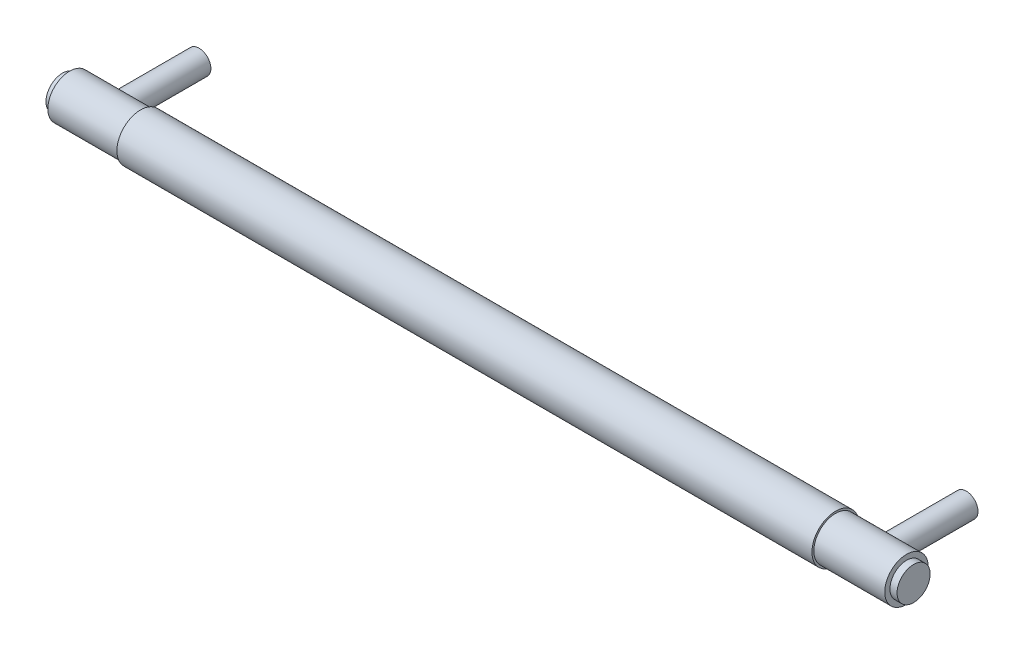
ISO-10303-21;
HEADER;
FILE_DESCRIPTION(('STEP AP214'),'2;1');
FILE_NAME('part.step','',(''),(''),'','','');
FILE_SCHEMA(('AUTOMOTIVE_DESIGN { 1 0 10303 214 1 1 1 1 }'));
ENDSEC;
DATA;
#1=APPLICATION_CONTEXT('core data for automotive mechanical design processes');
#2=APPLICATION_PROTOCOL_DEFINITION('international standard','automotive_design',2000,#1);
#3=PRODUCT_CONTEXT('',#1,'mechanical');
#4=PRODUCT('Part','Part','',(#3));
#5=PRODUCT_RELATED_PRODUCT_CATEGORY('part','',(#4));
#6=PRODUCT_DEFINITION_FORMATION('','',#4);
#7=PRODUCT_DEFINITION_CONTEXT('part definition',#1,'design');
#8=PRODUCT_DEFINITION('design','',#6,#7);
#9=PRODUCT_DEFINITION_SHAPE('','',#8);
#10=(LENGTH_UNIT() NAMED_UNIT(*) SI_UNIT(.MILLI.,.METRE.));
#11=(NAMED_UNIT(*) PLANE_ANGLE_UNIT() SI_UNIT($,.RADIAN.));
#12=(NAMED_UNIT(*) SI_UNIT($,.STERADIAN.) SOLID_ANGLE_UNIT());
#13=UNCERTAINTY_MEASURE_WITH_UNIT(LENGTH_MEASURE(1.E-05),#10,'distance_accuracy_value','');
#14=(GEOMETRIC_REPRESENTATION_CONTEXT(3) GLOBAL_UNCERTAINTY_ASSIGNED_CONTEXT((#13)) GLOBAL_UNIT_ASSIGNED_CONTEXT((#10,
#11,#12)) REPRESENTATION_CONTEXT('',''));
#15=CARTESIAN_POINT('',(0.,0.,0.));
#16=DIRECTION('',(0.,0.,1.));
#17=DIRECTION('',(1.,0.,0.));
#18=AXIS2_PLACEMENT_3D('',#15,#16,#17);
#19=CARTESIAN_POINT('',(177.,0.,0.));
#20=DIRECTION('',(-1.,0.,0.));
#21=DIRECTION('',(0.,0.,1.));
#22=AXIS2_PLACEMENT_3D('',#19,#20,#21);
#23=CYLINDRICAL_SURFACE('',#22,9.2);
#24=CARTESIAN_POINT('',(147.,0.,0.));
#25=DIRECTION('',(1.,0.,0.));
#26=DIRECTION('',(0.,0.,-1.));
#27=AXIS2_PLACEMENT_3D('',#24,#25,#26);
#28=CIRCLE('',#27,9.2);
#29=CARTESIAN_POINT('',(147.,0.,-9.2));
#30=VERTEX_POINT('',#29);
#31=EDGE_CURVE('E108',#30,#30,#28,.T.);
#32=ORIENTED_EDGE('',*,*,#31,.T.);
#33=EDGE_LOOP('',(#32));
#34=FACE_BOUND('',#33,.T.);
#35=CARTESIAN_POINT('',(177.,0.,0.));
#36=DIRECTION('',(1.,0.,0.));
#37=DIRECTION('',(0.,0.,-1.));
#38=AXIS2_PLACEMENT_3D('',#35,#36,#37);
#39=CIRCLE('',#38,9.2);
#40=CARTESIAN_POINT('',(177.,0.,-9.2));
#41=VERTEX_POINT('',#40);
#42=EDGE_CURVE('E109',#41,#41,#39,.T.);
#43=ORIENTED_EDGE('',*,*,#42,.F.);
#44=EDGE_LOOP('',(#43));
#45=FACE_BOUND('',#44,.T.);
#46=CARTESIAN_POINT('',(167.25,0.,-9.2));
#47=CARTESIAN_POINT('',(167.250001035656,-0.130074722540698,-9.20000090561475));
#48=CARTESIAN_POINT('',(167.244919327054,-0.260136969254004,-9.19723589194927));
#49=CARTESIAN_POINT('',(167.224659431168,-0.519285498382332,-9.18624856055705));
#50=CARTESIAN_POINT('',(167.209478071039,-0.648371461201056,-9.17802452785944));
#51=CARTESIAN_POINT('',(167.169189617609,-0.904665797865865,-9.15631689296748));
#52=CARTESIAN_POINT('',(167.144072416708,-1.03187212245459,-9.14282793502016));
#53=CARTESIAN_POINT('',(167.084208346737,-1.28341476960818,-9.11092364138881));
#54=CARTESIAN_POINT('',(167.04945754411,-1.40774989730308,-9.0925062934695));
#55=CARTESIAN_POINT('',(166.970895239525,-1.65213298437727,-9.05128374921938));
#56=CARTESIAN_POINT('',(166.927125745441,-1.77219789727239,-9.02849892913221));
#57=CARTESIAN_POINT('',(166.83086498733,-2.00796183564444,-8.9790104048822));
#58=CARTESIAN_POINT('',(166.778370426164,-2.12365919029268,-8.95230521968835));
#59=CARTESIAN_POINT('',(166.608525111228,-2.46316888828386,-8.86719116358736));
#60=CARTESIAN_POINT('',(166.478734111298,-2.67964052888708,-8.80374126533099));
#61=CARTESIAN_POINT('',(166.179944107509,-3.10276985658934,-8.66405646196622));
#62=CARTESIAN_POINT('',(166.008884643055,-3.30776927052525,-8.58724663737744));
#63=CARTESIAN_POINT('',(165.636938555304,-3.68774436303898,-8.4310608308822));
#64=CARTESIAN_POINT('',(165.436025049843,-3.86269267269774,-8.35168258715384));
#65=CARTESIAN_POINT('',(164.986960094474,-4.19453179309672,-8.19042783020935));
#66=CARTESIAN_POINT('',(164.736128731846,-4.34809630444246,-8.10903821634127));
#67=CARTESIAN_POINT('',(164.340003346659,-4.54463175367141,-7.99949849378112));
#68=CARTESIAN_POINT('',(164.20460087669,-4.60452242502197,-7.96506681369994));
#69=CARTESIAN_POINT('',(163.927917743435,-4.7123873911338,-7.90172843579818));
#70=CARTESIAN_POINT('',(163.786640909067,-4.76036931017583,-7.87281820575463));
#71=CARTESIAN_POINT('',(163.508188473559,-4.84114175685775,-7.82339132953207));
#72=CARTESIAN_POINT('',(163.371306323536,-4.87469290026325,-7.80246375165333));
#73=CARTESIAN_POINT('',(163.094408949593,-4.9302019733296,-7.76750851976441));
#74=CARTESIAN_POINT('',(162.954395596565,-4.95216664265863,-7.75347685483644));
#75=CARTESIAN_POINT('',(162.67258350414,-4.98412633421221,-7.73297147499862));
#76=CARTESIAN_POINT('',(162.530786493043,-4.99413215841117,-7.72649093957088));
#77=CARTESIAN_POINT('',(162.246722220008,-5.0020165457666,-7.72138953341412));
#78=CARTESIAN_POINT('',(162.104455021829,-4.99989669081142,-7.72276763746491));
#79=CARTESIAN_POINT('',(161.841925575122,-4.98478878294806,-7.73252471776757));
#80=CARTESIAN_POINT('',(161.721523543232,-4.97345607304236,-7.73983711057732));
#81=CARTESIAN_POINT('',(161.482260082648,-4.942179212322,-7.75984601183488));
#82=CARTESIAN_POINT('',(161.363399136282,-4.92223242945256,-7.77254416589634));
#83=CARTESIAN_POINT('',(161.12803831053,-4.87397481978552,-7.80289558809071));
#84=CARTESIAN_POINT('',(161.011538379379,-4.84566417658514,-7.82054874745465));
#85=CARTESIAN_POINT('',(160.781543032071,-4.78099629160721,-7.86024868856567));
#86=CARTESIAN_POINT('',(160.668048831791,-4.74463584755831,-7.88229721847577));
#87=CARTESIAN_POINT('',(160.328154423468,-4.62225510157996,-7.95511924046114));
#88=CARTESIAN_POINT('',(160.107319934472,-4.52396510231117,-8.01188661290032));
#89=CARTESIAN_POINT('',(159.684260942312,-4.29821090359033,-8.13522490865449));
#90=CARTESIAN_POINT('',(159.482044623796,-4.17073395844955,-8.20180011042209));
#91=CARTESIAN_POINT('',(159.069163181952,-3.86749973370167,-8.34955553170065));
#92=CARTESIAN_POINT('',(158.86196454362,-3.68733528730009,-8.43140910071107));
#93=CARTESIAN_POINT('',(158.479057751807,-3.29471585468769,-8.59242600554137));
#94=CARTESIAN_POINT('',(158.303370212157,-3.08223989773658,-8.67158755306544));
#95=CARTESIAN_POINT('',(158.061812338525,-2.73508983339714,-8.78495686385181));
#96=CARTESIAN_POINT('',(157.982990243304,-2.61045949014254,-8.82288451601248));
#97=CARTESIAN_POINT('',(157.836257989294,-2.35386813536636,-8.89477478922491));
#98=CARTESIAN_POINT('',(157.768343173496,-2.22191028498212,-8.92873910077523));
#99=CARTESIAN_POINT('',(157.644183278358,-1.95155644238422,-8.99170105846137));
#100=CARTESIAN_POINT('',(157.587932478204,-1.81316364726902,-9.02070113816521));
#101=CARTESIAN_POINT('',(157.487782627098,-1.53091383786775,-9.07286528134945));
#102=CARTESIAN_POINT('',(157.443881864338,-1.38705758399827,-9.09603015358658));
#103=CARTESIAN_POINT('',(157.372513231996,-1.10853590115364,-9.13395050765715));
#104=CARTESIAN_POINT('',(157.343906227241,-0.97424021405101,-9.14928303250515));
#105=CARTESIAN_POINT('',(157.297792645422,-0.703227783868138,-9.17409277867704));
#106=CARTESIAN_POINT('',(157.280284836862,-0.566511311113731,-9.18357064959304));
#107=CARTESIAN_POINT('',(157.256625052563,-0.29187989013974,-9.19639574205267));
#108=CARTESIAN_POINT('',(157.250467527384,-0.153965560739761,-9.19974595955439));
#109=CARTESIAN_POINT('',(157.24958386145,0.12190663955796,-9.20022611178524));
#110=CARTESIAN_POINT('',(157.25485701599,0.259864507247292,-9.19735642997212));
#111=CARTESIAN_POINT('',(157.275708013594,0.521504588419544,-9.18605000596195));
#112=CARTESIAN_POINT('',(157.290256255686,0.64529467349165,-9.17816969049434));
#113=CARTESIAN_POINT('',(157.328472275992,0.891088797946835,-9.15757479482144));
#114=CARTESIAN_POINT('',(157.352142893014,1.01309226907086,-9.1448587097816));
#115=CARTESIAN_POINT('',(157.408333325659,1.25443425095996,-9.11488727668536));
#116=CARTESIAN_POINT('',(157.440850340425,1.37377359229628,-9.09763336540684));
#117=CARTESIAN_POINT('',(157.514396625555,1.60912592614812,-9.05897178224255));
#118=CARTESIAN_POINT('',(157.555429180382,1.7251376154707,-9.0375625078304));
#119=CARTESIAN_POINT('',(157.692832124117,2.0724482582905,-8.9666859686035));
#120=CARTESIAN_POINT('',(157.80222449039,2.29754525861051,-8.91127618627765));
#121=CARTESIAN_POINT('',(158.051555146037,2.72668339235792,-8.78949008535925));
#122=CARTESIAN_POINT('',(158.191504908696,2.93071657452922,-8.72310964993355));
#123=CARTESIAN_POINT('',(158.515646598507,3.33604084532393,-8.5768397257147));
#124=CARTESIAN_POINT('',(158.703016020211,3.53454639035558,-8.49626779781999));
#125=CARTESIAN_POINT('',(159.107841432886,3.89884933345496,-8.3353877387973));
#126=CARTESIAN_POINT('',(159.325327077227,4.06461409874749,-8.25507994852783));
#127=CARTESIAN_POINT('',(159.679615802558,4.29124185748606,-8.13837911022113));
#128=CARTESIAN_POINT('',(159.807207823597,4.36516170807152,-8.0988551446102));
#129=CARTESIAN_POINT('',(160.069309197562,4.50182228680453,-8.02369412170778));
#130=CARTESIAN_POINT('',(160.203815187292,4.56456838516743,-7.98805520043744));
#131=CARTESIAN_POINT('',(160.478867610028,4.67816332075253,-7.92206455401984));
#132=CARTESIAN_POINT('',(160.619408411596,4.72902297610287,-7.89170802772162));
#133=CARTESIAN_POINT('',(160.905644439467,4.81821167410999,-7.83757391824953));
#134=CARTESIAN_POINT('',(161.051338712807,4.85654302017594,-7.81379512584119));
#135=CARTESIAN_POINT('',(161.332218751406,4.91693572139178,-7.77591708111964));
#136=CARTESIAN_POINT('',(161.467045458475,4.94021834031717,-7.76110050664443));
#137=CARTESIAN_POINT('',(161.738723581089,4.97567628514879,-7.7384167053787));
#138=CARTESIAN_POINT('',(161.875574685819,4.98785329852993,-7.73054842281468));
#139=CARTESIAN_POINT('',(162.149954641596,5.00088423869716,-7.72212521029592));
#140=CARTESIAN_POINT('',(162.287483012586,5.0017452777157,-7.72156568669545));
#141=CARTESIAN_POINT('',(162.561968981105,4.99214702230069,-7.72777464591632));
#142=CARTESIAN_POINT('',(162.698926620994,4.98168858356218,-7.73454257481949));
#143=CARTESIAN_POINT('',(162.953194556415,4.95173663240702,-7.7537456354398));
#144=CARTESIAN_POINT('',(163.070732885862,4.93360287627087,-7.7653243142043));
#145=CARTESIAN_POINT('',(163.303669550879,4.88915719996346,-7.79338335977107));
#146=CARTESIAN_POINT('',(163.419067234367,4.86284282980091,-7.8098651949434));
#147=CARTESIAN_POINT('',(163.760997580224,4.77204459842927,-7.86592091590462));
#148=CARTESIAN_POINT('',(163.983409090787,4.69568852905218,-7.91211668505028));
#149=CARTESIAN_POINT('',(164.426159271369,4.508414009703,-8.02038246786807));
#150=CARTESIAN_POINT('',(164.64549505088,4.39562987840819,-8.08326570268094));
#151=CARTESIAN_POINT('',(165.063636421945,4.14046696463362,-8.21688922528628));
#152=CARTESIAN_POINT('',(165.262430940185,3.99807234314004,-8.28763370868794));
#153=CARTESIAN_POINT('',(165.665342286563,3.66254871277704,-8.44184811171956));
#154=CARTESIAN_POINT('',(165.86567297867,3.46499766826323,-8.52561746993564));
#155=CARTESIAN_POINT('',(166.231654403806,3.03735701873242,-8.68715056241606));
#156=CARTESIAN_POINT('',(166.397281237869,2.8072451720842,-8.76491013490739));
#157=CARTESIAN_POINT('',(166.61800821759,2.43762496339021,-8.87216065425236));
#158=CARTESIAN_POINT('',(166.687800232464,2.30818012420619,-8.90679581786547));
#159=CARTESIAN_POINT('',(166.816072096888,2.04271439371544,-8.97139528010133));
#160=CARTESIAN_POINT('',(166.874557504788,1.90669677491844,-9.00136187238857));
#161=CARTESIAN_POINT('',(166.979411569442,1.62929850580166,-9.05567934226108));
#162=CARTESIAN_POINT('',(167.025803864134,1.48792894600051,-9.0800411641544));
#163=CARTESIAN_POINT('',(167.10595335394,1.20079805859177,-9.12245171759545));
#164=CARTESIAN_POINT('',(167.139717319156,1.05503912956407,-9.1405038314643));
#165=CARTESIAN_POINT('',(167.194445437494,0.758588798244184,-9.16989641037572));
#166=CARTESIAN_POINT('',(167.215246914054,0.607858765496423,-9.18115152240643));
#167=CARTESIAN_POINT('',(167.243023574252,0.30474678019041,-9.19620277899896));
#168=CARTESIAN_POINT('',(167.24999878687,0.152364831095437,-9.1999989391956));
#169=CARTESIAN_POINT('',(167.25,0.,-9.2));
#170=B_SPLINE_CURVE_WITH_KNOTS('',3,(#46,#47,#48,#49,#50,#51,#52,#53,#54,#55,#56,#57,#58,#59,
#60,#61,#62,#63,#64,#65,#66,#67,#68,#69,#70,#71,#72,#73,#74,#75,#76,#77,#78,#79,#80,#81,#82,#83,
#84,#85,#86,#87,#88,#89,#90,#91,#92,#93,#94,#95,#96,#97,#98,#99,#100,#101,#102,#103,#104,#105,
#106,#107,#108,#109,#110,#111,#112,#113,#114,#115,#116,#117,#118,#119,#120,#121,#122,#123,#124,
#125,#126,#127,#128,#129,#130,#131,#132,#133,#134,#135,#136,#137,#138,#139,#140,#141,#142,#143,
#144,#145,#146,#147,#148,#149,#150,#151,#152,#153,#154,#155,#156,#157,#158,#159,#160,#161,#162,
#163,#164,#165,#166,#167,#168,#169),.UNSPECIFIED.,.T.,.F.,(4,2,2,2,2,2,2,2,2,2,2,2,2,2,2,2,2,2,
2,2,2,2,2,2,2,2,2,2,2,2,2,2,2,2,2,2,2,2,2,2,2,2,2,2,2,2,2,2,2,2,2,2,2,2,2,2,2,2,2,2,2,4),(0.,
0.390074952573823,0.780272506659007,1.1708680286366,1.56162327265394,1.95059798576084,
2.33972002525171,3.11719990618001,3.94734927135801,4.77825072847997,5.68860389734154,
6.14407900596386,6.59926175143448,7.02606566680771,7.45262104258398,7.87879083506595,
8.30490503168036,8.66793889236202,9.03108375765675,9.39422065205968,9.7575022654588,
10.4992817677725,11.2413858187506,12.0973849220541,12.9539419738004,13.4102132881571,
13.8662892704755,14.3221410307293,14.7779295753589,15.1918463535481,15.6057171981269,
16.0193856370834,16.4330285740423,16.8072633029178,17.1816145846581,17.5558474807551,
17.9302249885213,18.6957960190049,19.4616549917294,20.3120011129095,21.1631905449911,
21.6206680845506,22.0779251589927,22.5347644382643,22.9915196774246,23.4037762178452,
23.815970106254,24.2279049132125,24.6398085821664,24.9978688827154,25.3560365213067,
26.0719476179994,26.8327119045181,27.5938841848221,28.4707847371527,29.3482872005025,
29.8010085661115,30.2535068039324,30.7051138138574,31.1564783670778,31.6133990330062,
32.0703187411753),.UNSPECIFIED.);
#171=CARTESIAN_POINT('',(167.25,0.,-9.2));
#172=VERTEX_POINT('',#171);
#173=EDGE_CURVE('E10',#172,#172,#170,.T.);
#174=ORIENTED_EDGE('',*,*,#173,.F.);
#175=EDGE_LOOP('',(#174));
#176=FACE_BOUND('',#175,.T.);
#177=ADVANCED_FACE('F30',(#34,#45,#176),#23,.T.);
#178=CARTESIAN_POINT('',(177.,0.,0.));
#179=DIRECTION('',(1.,0.,0.));
#180=DIRECTION('',(0.,0.,-1.));
#181=AXIS2_PLACEMENT_3D('',#178,#179,#180);
#182=PLANE('',#181);
#183=ORIENTED_EDGE('',*,*,#42,.T.);
#184=EDGE_LOOP('',(#183));
#185=FACE_BOUND('',#184,.T.);
#186=CARTESIAN_POINT('',(177.,0.,0.));
#187=DIRECTION('',(1.,0.,0.));
#188=DIRECTION('',(0.,0.,-1.));
#189=AXIS2_PLACEMENT_3D('',#186,#187,#188);
#190=CIRCLE('',#189,7.);
#191=CARTESIAN_POINT('',(177.,0.,-7.));
#192=VERTEX_POINT('',#191);
#193=EDGE_CURVE('E115',#192,#192,#190,.T.);
#194=ORIENTED_EDGE('',*,*,#193,.F.);
#195=EDGE_LOOP('',(#194));
#196=FACE_BOUND('',#195,.T.);
#197=ADVANCED_FACE('F84',(#185,#196),#182,.T.);
#198=CARTESIAN_POINT('',(147.,0.,0.));
#199=DIRECTION('',(1.,0.,0.));
#200=DIRECTION('',(0.,0.,-1.));
#201=AXIS2_PLACEMENT_3D('',#198,#199,#200);
#202=PLANE('',#201);
#203=CARTESIAN_POINT('',(147.,0.,0.));
#204=DIRECTION('',(1.,0.,0.));
#205=DIRECTION('',(0.,0.,-1.));
#206=AXIS2_PLACEMENT_3D('',#203,#204,#205);
#207=CIRCLE('',#206,10.);
#208=CARTESIAN_POINT('',(147.,0.,-10.));
#209=VERTEX_POINT('',#208);
#210=EDGE_CURVE('E106',#209,#209,#207,.T.);
#211=ORIENTED_EDGE('',*,*,#210,.T.);
#212=EDGE_LOOP('',(#211));
#213=FACE_BOUND('',#212,.T.);
#214=ORIENTED_EDGE('',*,*,#31,.F.);
#215=EDGE_LOOP('',(#214));
#216=FACE_BOUND('',#215,.T.);
#217=ADVANCED_FACE('F89',(#213,#216),#202,.T.);
#218=CARTESIAN_POINT('',(147.,0.,0.));
#219=DIRECTION('',(-1.,0.,0.));
#220=DIRECTION('',(0.,0.,1.));
#221=AXIS2_PLACEMENT_3D('',#218,#219,#220);
#222=CYLINDRICAL_SURFACE('',#221,10.);
#223=ORIENTED_EDGE('',*,*,#210,.F.);
#224=EDGE_LOOP('',(#223));
#225=FACE_BOUND('',#224,.T.);
#226=CARTESIAN_POINT('',(-147.,0.,0.));
#227=DIRECTION('',(1.,0.,0.));
#228=DIRECTION('',(0.,0.,-1.));
#229=AXIS2_PLACEMENT_3D('',#226,#227,#228);
#230=CIRCLE('',#229,10.);
#231=CARTESIAN_POINT('',(-147.,0.,-10.));
#232=VERTEX_POINT('',#231);
#233=EDGE_CURVE('E128',#232,#232,#230,.T.);
#234=ORIENTED_EDGE('',*,*,#233,.T.);
#235=EDGE_LOOP('',(#234));
#236=FACE_BOUND('',#235,.T.);
#237=ADVANCED_FACE('F32',(#225,#236),#222,.T.);
#238=CARTESIAN_POINT('',(180.,0.,0.));
#239=DIRECTION('',(-1.,0.,0.));
#240=DIRECTION('',(0.,0.,1.));
#241=AXIS2_PLACEMENT_3D('',#238,#239,#240);
#242=CYLINDRICAL_SURFACE('',#241,7.);
#243=CARTESIAN_POINT('',(180.,0.,0.));
#244=DIRECTION('',(1.,0.,0.));
#245=DIRECTION('',(0.,0.,-1.));
#246=AXIS2_PLACEMENT_3D('',#243,#244,#245);
#247=CIRCLE('',#246,7.);
#248=CARTESIAN_POINT('',(180.,0.,-7.));
#249=VERTEX_POINT('',#248);
#250=EDGE_CURVE('E110',#249,#249,#247,.T.);
#251=ORIENTED_EDGE('',*,*,#250,.F.);
#252=EDGE_LOOP('',(#251));
#253=FACE_BOUND('',#252,.T.);
#254=ORIENTED_EDGE('',*,*,#193,.T.);
#255=EDGE_LOOP('',(#254));
#256=FACE_BOUND('',#255,.T.);
#257=ADVANCED_FACE('F101',(#253,#256),#242,.T.);
#258=CARTESIAN_POINT('',(180.,0.,0.));
#259=DIRECTION('',(1.,0.,0.));
#260=DIRECTION('',(0.,0.,-1.));
#261=AXIS2_PLACEMENT_3D('',#258,#259,#260);
#262=PLANE('',#261);
#263=ORIENTED_EDGE('',*,*,#250,.T.);
#264=EDGE_LOOP('',(#263));
#265=FACE_BOUND('',#264,.T.);
#266=ADVANCED_FACE('F125',(#265),#262,.T.);
#267=CARTESIAN_POINT('',(-147.,0.,0.));
#268=DIRECTION('',(-1.,0.,0.));
#269=DIRECTION('',(0.,0.,-1.));
#270=AXIS2_PLACEMENT_3D('',#267,#268,#269);
#271=PLANE('',#270);
#272=CARTESIAN_POINT('',(-147.,0.,0.));
#273=DIRECTION('',(-1.,0.,0.));
#274=DIRECTION('',(0.,0.,1.));
#275=AXIS2_PLACEMENT_3D('',#272,#273,#274);
#276=CIRCLE('',#275,9.2);
#277=CARTESIAN_POINT('',(-147.,0.,9.2));
#278=VERTEX_POINT('',#277);
#279=EDGE_CURVE('E49',#278,#278,#276,.T.);
#280=ORIENTED_EDGE('',*,*,#279,.F.);
#281=EDGE_LOOP('',(#280));
#282=FACE_BOUND('',#281,.T.);
#283=ORIENTED_EDGE('',*,*,#233,.F.);
#284=EDGE_LOOP('',(#283));
#285=FACE_BOUND('',#284,.T.);
#286=ADVANCED_FACE('F79',(#282,#285),#271,.T.);
#287=CARTESIAN_POINT('',(-177.,0.,0.));
#288=DIRECTION('',(1.,0.,0.));
#289=DIRECTION('',(0.,0.,-1.));
#290=AXIS2_PLACEMENT_3D('',#287,#288,#289);
#291=CYLINDRICAL_SURFACE('',#290,9.2);
#292=CARTESIAN_POINT('',(-167.25,0.,-9.2));
#293=CARTESIAN_POINT('',(-167.250001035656,0.130074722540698,-9.20000090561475));
#294=CARTESIAN_POINT('',(-167.244919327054,0.260136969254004,-9.19723589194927));
#295=CARTESIAN_POINT('',(-167.224659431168,0.519285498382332,-9.18624856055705));
#296=CARTESIAN_POINT('',(-167.209478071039,0.648371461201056,-9.17802452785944));
#297=CARTESIAN_POINT('',(-167.169189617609,0.904665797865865,-9.15631689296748));
#298=CARTESIAN_POINT('',(-167.144072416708,1.03187212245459,-9.14282793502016));
#299=CARTESIAN_POINT('',(-167.084208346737,1.28341476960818,-9.11092364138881));
#300=CARTESIAN_POINT('',(-167.04945754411,1.40774989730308,-9.0925062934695));
#301=CARTESIAN_POINT('',(-166.970895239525,1.65213298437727,-9.05128374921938));
#302=CARTESIAN_POINT('',(-166.927125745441,1.77219789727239,-9.02849892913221));
#303=CARTESIAN_POINT('',(-166.83086498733,2.00796183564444,-8.9790104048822));
#304=CARTESIAN_POINT('',(-166.778370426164,2.12365919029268,-8.95230521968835));
#305=CARTESIAN_POINT('',(-166.608525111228,2.46316888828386,-8.86719116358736));
#306=CARTESIAN_POINT('',(-166.478734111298,2.67964052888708,-8.80374126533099));
#307=CARTESIAN_POINT('',(-166.179944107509,3.10276985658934,-8.66405646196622));
#308=CARTESIAN_POINT('',(-166.008884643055,3.30776927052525,-8.58724663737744));
#309=CARTESIAN_POINT('',(-165.636938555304,3.68774436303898,-8.4310608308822));
#310=CARTESIAN_POINT('',(-165.436025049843,3.86269267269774,-8.35168258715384));
#311=CARTESIAN_POINT('',(-164.986960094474,4.19453179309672,-8.19042783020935));
#312=CARTESIAN_POINT('',(-164.736128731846,4.34809630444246,-8.10903821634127));
#313=CARTESIAN_POINT('',(-164.340003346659,4.54463175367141,-7.99949849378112));
#314=CARTESIAN_POINT('',(-164.20460087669,4.60452242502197,-7.96506681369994));
#315=CARTESIAN_POINT('',(-163.927917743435,4.7123873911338,-7.90172843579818));
#316=CARTESIAN_POINT('',(-163.786640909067,4.76036931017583,-7.87281820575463));
#317=CARTESIAN_POINT('',(-163.508188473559,4.84114175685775,-7.82339132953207));
#318=CARTESIAN_POINT('',(-163.371306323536,4.87469290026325,-7.80246375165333));
#319=CARTESIAN_POINT('',(-163.094408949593,4.9302019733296,-7.76750851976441));
#320=CARTESIAN_POINT('',(-162.954395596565,4.95216664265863,-7.75347685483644));
#321=CARTESIAN_POINT('',(-162.67258350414,4.98412633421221,-7.73297147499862));
#322=CARTESIAN_POINT('',(-162.530786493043,4.99413215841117,-7.72649093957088));
#323=CARTESIAN_POINT('',(-162.246722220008,5.0020165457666,-7.72138953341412));
#324=CARTESIAN_POINT('',(-162.104455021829,4.99989669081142,-7.72276763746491));
#325=CARTESIAN_POINT('',(-161.841925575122,4.98478878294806,-7.73252471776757));
#326=CARTESIAN_POINT('',(-161.721523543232,4.97345607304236,-7.73983711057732));
#327=CARTESIAN_POINT('',(-161.482260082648,4.942179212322,-7.75984601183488));
#328=CARTESIAN_POINT('',(-161.363399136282,4.92223242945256,-7.77254416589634));
#329=CARTESIAN_POINT('',(-161.12803831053,4.87397481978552,-7.80289558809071));
#330=CARTESIAN_POINT('',(-161.011538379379,4.84566417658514,-7.82054874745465));
#331=CARTESIAN_POINT('',(-160.781543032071,4.78099629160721,-7.86024868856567));
#332=CARTESIAN_POINT('',(-160.668048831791,4.74463584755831,-7.88229721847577));
#333=CARTESIAN_POINT('',(-160.328154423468,4.62225510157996,-7.95511924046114));
#334=CARTESIAN_POINT('',(-160.107319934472,4.52396510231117,-8.01188661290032));
#335=CARTESIAN_POINT('',(-159.684260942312,4.29821090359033,-8.13522490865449));
#336=CARTESIAN_POINT('',(-159.482044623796,4.17073395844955,-8.20180011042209));
#337=CARTESIAN_POINT('',(-159.069163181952,3.86749973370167,-8.34955553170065));
#338=CARTESIAN_POINT('',(-158.86196454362,3.68733528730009,-8.43140910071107));
#339=CARTESIAN_POINT('',(-158.479057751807,3.29471585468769,-8.59242600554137));
#340=CARTESIAN_POINT('',(-158.303370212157,3.08223989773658,-8.67158755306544));
#341=CARTESIAN_POINT('',(-158.061812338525,2.73508983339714,-8.78495686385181));
#342=CARTESIAN_POINT('',(-157.982990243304,2.61045949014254,-8.82288451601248));
#343=CARTESIAN_POINT('',(-157.836257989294,2.35386813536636,-8.89477478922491));
#344=CARTESIAN_POINT('',(-157.768343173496,2.22191028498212,-8.92873910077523));
#345=CARTESIAN_POINT('',(-157.644183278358,1.95155644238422,-8.99170105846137));
#346=CARTESIAN_POINT('',(-157.587932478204,1.81316364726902,-9.02070113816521));
#347=CARTESIAN_POINT('',(-157.487782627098,1.53091383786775,-9.07286528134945));
#348=CARTESIAN_POINT('',(-157.443881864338,1.38705758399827,-9.09603015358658));
#349=CARTESIAN_POINT('',(-157.372513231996,1.10853590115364,-9.13395050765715));
#350=CARTESIAN_POINT('',(-157.343906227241,0.97424021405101,-9.14928303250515));
#351=CARTESIAN_POINT('',(-157.297792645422,0.703227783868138,-9.17409277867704));
#352=CARTESIAN_POINT('',(-157.280284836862,0.566511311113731,-9.18357064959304));
#353=CARTESIAN_POINT('',(-157.256625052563,0.29187989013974,-9.19639574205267));
#354=CARTESIAN_POINT('',(-157.250467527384,0.153965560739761,-9.19974595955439));
#355=CARTESIAN_POINT('',(-157.24958386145,-0.12190663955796,-9.20022611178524));
#356=CARTESIAN_POINT('',(-157.25485701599,-0.259864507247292,-9.19735642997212));
#357=CARTESIAN_POINT('',(-157.275708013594,-0.521504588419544,-9.18605000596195));
#358=CARTESIAN_POINT('',(-157.290256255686,-0.64529467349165,-9.17816969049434));
#359=CARTESIAN_POINT('',(-157.328472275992,-0.891088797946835,-9.15757479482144));
#360=CARTESIAN_POINT('',(-157.352142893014,-1.01309226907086,-9.1448587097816));
#361=CARTESIAN_POINT('',(-157.408333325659,-1.25443425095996,-9.11488727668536));
#362=CARTESIAN_POINT('',(-157.440850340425,-1.37377359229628,-9.09763336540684));
#363=CARTESIAN_POINT('',(-157.514396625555,-1.60912592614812,-9.05897178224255));
#364=CARTESIAN_POINT('',(-157.555429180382,-1.7251376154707,-9.0375625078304));
#365=CARTESIAN_POINT('',(-157.692832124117,-2.0724482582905,-8.9666859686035));
#366=CARTESIAN_POINT('',(-157.80222449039,-2.29754525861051,-8.91127618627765));
#367=CARTESIAN_POINT('',(-158.051555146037,-2.72668339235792,-8.78949008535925));
#368=CARTESIAN_POINT('',(-158.191504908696,-2.93071657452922,-8.72310964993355));
#369=CARTESIAN_POINT('',(-158.515646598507,-3.33604084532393,-8.5768397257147));
#370=CARTESIAN_POINT('',(-158.703016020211,-3.53454639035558,-8.49626779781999));
#371=CARTESIAN_POINT('',(-159.107841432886,-3.89884933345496,-8.3353877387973));
#372=CARTESIAN_POINT('',(-159.325327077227,-4.06461409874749,-8.25507994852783));
#373=CARTESIAN_POINT('',(-159.679615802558,-4.29124185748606,-8.13837911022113));
#374=CARTESIAN_POINT('',(-159.807207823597,-4.36516170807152,-8.0988551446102));
#375=CARTESIAN_POINT('',(-160.069309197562,-4.50182228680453,-8.02369412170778));
#376=CARTESIAN_POINT('',(-160.203815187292,-4.56456838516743,-7.98805520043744));
#377=CARTESIAN_POINT('',(-160.478867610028,-4.67816332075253,-7.92206455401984));
#378=CARTESIAN_POINT('',(-160.619408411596,-4.72902297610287,-7.89170802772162));
#379=CARTESIAN_POINT('',(-160.905644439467,-4.81821167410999,-7.83757391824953));
#380=CARTESIAN_POINT('',(-161.051338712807,-4.85654302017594,-7.81379512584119));
#381=CARTESIAN_POINT('',(-161.332218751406,-4.91693572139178,-7.77591708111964));
#382=CARTESIAN_POINT('',(-161.467045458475,-4.94021834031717,-7.76110050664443));
#383=CARTESIAN_POINT('',(-161.738723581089,-4.97567628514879,-7.7384167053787));
#384=CARTESIAN_POINT('',(-161.875574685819,-4.98785329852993,-7.73054842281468));
#385=CARTESIAN_POINT('',(-162.149954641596,-5.00088423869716,-7.72212521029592));
#386=CARTESIAN_POINT('',(-162.287483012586,-5.0017452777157,-7.72156568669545));
#387=CARTESIAN_POINT('',(-162.561968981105,-4.99214702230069,-7.72777464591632));
#388=CARTESIAN_POINT('',(-162.698926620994,-4.98168858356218,-7.73454257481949));
#389=CARTESIAN_POINT('',(-162.953194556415,-4.95173663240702,-7.7537456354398));
#390=CARTESIAN_POINT('',(-163.070732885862,-4.93360287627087,-7.7653243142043));
#391=CARTESIAN_POINT('',(-163.303669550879,-4.88915719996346,-7.79338335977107));
#392=CARTESIAN_POINT('',(-163.419067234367,-4.86284282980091,-7.8098651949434));
#393=CARTESIAN_POINT('',(-163.760997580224,-4.77204459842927,-7.86592091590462));
#394=CARTESIAN_POINT('',(-163.983409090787,-4.69568852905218,-7.91211668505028));
#395=CARTESIAN_POINT('',(-164.426159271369,-4.508414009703,-8.02038246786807));
#396=CARTESIAN_POINT('',(-164.64549505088,-4.39562987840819,-8.08326570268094));
#397=CARTESIAN_POINT('',(-165.063636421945,-4.14046696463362,-8.21688922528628));
#398=CARTESIAN_POINT('',(-165.262430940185,-3.99807234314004,-8.28763370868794));
#399=CARTESIAN_POINT('',(-165.665342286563,-3.66254871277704,-8.44184811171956));
#400=CARTESIAN_POINT('',(-165.86567297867,-3.46499766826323,-8.52561746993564));
#401=CARTESIAN_POINT('',(-166.231654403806,-3.03735701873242,-8.68715056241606));
#402=CARTESIAN_POINT('',(-166.397281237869,-2.8072451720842,-8.76491013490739));
#403=CARTESIAN_POINT('',(-166.61800821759,-2.43762496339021,-8.87216065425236));
#404=CARTESIAN_POINT('',(-166.687800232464,-2.30818012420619,-8.90679581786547));
#405=CARTESIAN_POINT('',(-166.816072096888,-2.04271439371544,-8.97139528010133));
#406=CARTESIAN_POINT('',(-166.874557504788,-1.90669677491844,-9.00136187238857));
#407=CARTESIAN_POINT('',(-166.979411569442,-1.62929850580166,-9.05567934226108));
#408=CARTESIAN_POINT('',(-167.025803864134,-1.48792894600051,-9.0800411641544));
#409=CARTESIAN_POINT('',(-167.10595335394,-1.20079805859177,-9.12245171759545));
#410=CARTESIAN_POINT('',(-167.139717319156,-1.05503912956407,-9.1405038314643));
#411=CARTESIAN_POINT('',(-167.194445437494,-0.758588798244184,-9.16989641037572));
#412=CARTESIAN_POINT('',(-167.215246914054,-0.607858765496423,-9.18115152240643));
#413=CARTESIAN_POINT('',(-167.243023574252,-0.30474678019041,-9.19620277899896));
#414=CARTESIAN_POINT('',(-167.24999878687,-0.152364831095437,-9.1999989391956));
#415=CARTESIAN_POINT('',(-167.25,0.,-9.2));
#416=B_SPLINE_CURVE_WITH_KNOTS('',3,(#292,#293,#294,#295,#296,#297,#298,#299,#300,#301,#302,
#303,#304,#305,#306,#307,#308,#309,#310,#311,#312,#313,#314,#315,#316,#317,#318,#319,#320,#321,
#322,#323,#324,#325,#326,#327,#328,#329,#330,#331,#332,#333,#334,#335,#336,#337,#338,#339,#340,
#341,#342,#343,#344,#345,#346,#347,#348,#349,#350,#351,#352,#353,#354,#355,#356,#357,#358,#359,
#360,#361,#362,#363,#364,#365,#366,#367,#368,#369,#370,#371,#372,#373,#374,#375,#376,#377,#378,
#379,#380,#381,#382,#383,#384,#385,#386,#387,#388,#389,#390,#391,#392,#393,#394,#395,#396,#397,
#398,#399,#400,#401,#402,#403,#404,#405,#406,#407,#408,#409,#410,#411,#412,#413,#414,#415),
.UNSPECIFIED.,.T.,.F.,(4,2,2,2,2,2,2,2,2,2,2,2,2,2,2,2,2,2,2,2,2,2,2,2,2,2,2,2,2,2,2,2,2,2,2,2,
2,2,2,2,2,2,2,2,2,2,2,2,2,2,2,2,2,2,2,2,2,2,2,2,2,4),(0.,0.390074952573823,0.780272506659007,
1.1708680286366,1.56162327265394,1.95059798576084,2.33972002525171,3.11719990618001,
3.94734927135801,4.77825072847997,5.68860389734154,6.14407900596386,6.59926175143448,
7.02606566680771,7.45262104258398,7.87879083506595,8.30490503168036,8.66793889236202,
9.03108375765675,9.39422065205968,9.7575022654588,10.4992817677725,11.2413858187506,
12.0973849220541,12.9539419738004,13.4102132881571,13.8662892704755,14.3221410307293,
14.7779295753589,15.1918463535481,15.6057171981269,16.0193856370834,16.4330285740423,
16.8072633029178,17.1816145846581,17.5558474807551,17.9302249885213,18.6957960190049,
19.4616549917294,20.3120011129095,21.1631905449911,21.6206680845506,22.0779251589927,
22.5347644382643,22.9915196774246,23.4037762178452,23.815970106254,24.2279049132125,
24.6398085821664,24.9978688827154,25.3560365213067,26.0719476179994,26.8327119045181,
27.5938841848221,28.4707847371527,29.3482872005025,29.8010085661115,30.2535068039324,
30.7051138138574,31.1564783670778,31.6133990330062,32.0703187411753),.UNSPECIFIED.);
#417=CARTESIAN_POINT('',(-167.25,0.,-9.2));
#418=VERTEX_POINT('',#417);
#419=EDGE_CURVE('E41',#418,#418,#416,.T.);
#420=ORIENTED_EDGE('',*,*,#419,.F.);
#421=EDGE_LOOP('',(#420));
#422=FACE_BOUND('',#421,.T.);
#423=CARTESIAN_POINT('',(-177.,0.,0.));
#424=DIRECTION('',(1.,0.,0.));
#425=DIRECTION('',(0.,0.,-1.));
#426=AXIS2_PLACEMENT_3D('',#423,#424,#425);
#427=CIRCLE('',#426,9.2);
#428=CARTESIAN_POINT('',(-177.,0.,-9.2));
#429=VERTEX_POINT('',#428);
#430=EDGE_CURVE('E130',#429,#429,#427,.T.);
#431=ORIENTED_EDGE('',*,*,#430,.T.);
#432=EDGE_LOOP('',(#431));
#433=FACE_BOUND('',#432,.T.);
#434=ORIENTED_EDGE('',*,*,#279,.T.);
#435=EDGE_LOOP('',(#434));
#436=FACE_BOUND('',#435,.T.);
#437=ADVANCED_FACE('F56',(#422,#433,#436),#291,.T.);
#438=CARTESIAN_POINT('',(-177.,0.,0.));
#439=DIRECTION('',(-1.,0.,0.));
#440=DIRECTION('',(0.,0.,-1.));
#441=AXIS2_PLACEMENT_3D('',#438,#439,#440);
#442=PLANE('',#441);
#443=CARTESIAN_POINT('',(-177.,0.,0.));
#444=DIRECTION('',(-1.,0.,0.));
#445=DIRECTION('',(0.,0.,1.));
#446=AXIS2_PLACEMENT_3D('',#443,#444,#445);
#447=CIRCLE('',#446,7.);
#448=CARTESIAN_POINT('',(-177.,0.,7.));
#449=VERTEX_POINT('',#448);
#450=EDGE_CURVE('E45',#449,#449,#447,.T.);
#451=ORIENTED_EDGE('',*,*,#450,.F.);
#452=EDGE_LOOP('',(#451));
#453=FACE_BOUND('',#452,.T.);
#454=ORIENTED_EDGE('',*,*,#430,.F.);
#455=EDGE_LOOP('',(#454));
#456=FACE_BOUND('',#455,.T.);
#457=ADVANCED_FACE('F72',(#453,#456),#442,.T.);
#458=CARTESIAN_POINT('',(-180.,0.,0.));
#459=DIRECTION('',(1.,0.,0.));
#460=DIRECTION('',(0.,0.,-1.));
#461=AXIS2_PLACEMENT_3D('',#458,#459,#460);
#462=CYLINDRICAL_SURFACE('',#461,7.);
#463=CARTESIAN_POINT('',(-180.,0.,0.));
#464=DIRECTION('',(1.,0.,0.));
#465=DIRECTION('',(0.,0.,-1.));
#466=AXIS2_PLACEMENT_3D('',#463,#464,#465);
#467=CIRCLE('',#466,7.);
#468=CARTESIAN_POINT('',(-180.,0.,-7.));
#469=VERTEX_POINT('',#468);
#470=EDGE_CURVE('E134',#469,#469,#467,.T.);
#471=ORIENTED_EDGE('',*,*,#470,.T.);
#472=EDGE_LOOP('',(#471));
#473=FACE_BOUND('',#472,.T.);
#474=ORIENTED_EDGE('',*,*,#450,.T.);
#475=EDGE_LOOP('',(#474));
#476=FACE_BOUND('',#475,.T.);
#477=ADVANCED_FACE('F69',(#473,#476),#462,.T.);
#478=CARTESIAN_POINT('',(-180.,0.,0.));
#479=DIRECTION('',(-1.,0.,0.));
#480=DIRECTION('',(0.,0.,-1.));
#481=AXIS2_PLACEMENT_3D('',#478,#479,#480);
#482=PLANE('',#481);
#483=ORIENTED_EDGE('',*,*,#470,.F.);
#484=EDGE_LOOP('',(#483));
#485=FACE_BOUND('',#484,.T.);
#486=ADVANCED_FACE('F66',(#485),#482,.T.);
#487=CARTESIAN_POINT('',(-162.25,0.,-40.));
#488=DIRECTION('',(0.,0.,1.));
#489=DIRECTION('',(1.,0.,0.));
#490=AXIS2_PLACEMENT_3D('',#487,#488,#489);
#491=CYLINDRICAL_SURFACE('',#490,4.99999999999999);
#492=ORIENTED_EDGE('',*,*,#419,.T.);
#493=EDGE_LOOP('',(#492));
#494=FACE_BOUND('',#493,.T.);
#495=CARTESIAN_POINT('',(-162.25,0.,-40.));
#496=DIRECTION('',(0.,0.,1.));
#497=DIRECTION('',(1.,0.,0.));
#498=AXIS2_PLACEMENT_3D('',#495,#496,#497);
#499=CIRCLE('',#498,4.99999999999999);
#500=CARTESIAN_POINT('',(-157.25,0.,-40.));
#501=VERTEX_POINT('',#500);
#502=EDGE_CURVE('E139',#501,#501,#499,.T.);
#503=ORIENTED_EDGE('',*,*,#502,.T.);
#504=EDGE_LOOP('',(#503));
#505=FACE_BOUND('',#504,.T.);
#506=ADVANCED_FACE('F60',(#494,#505),#491,.T.);
#507=CARTESIAN_POINT('',(-162.25,0.,-40.));
#508=DIRECTION('',(0.,0.,1.));
#509=DIRECTION('',(1.,0.,0.));
#510=AXIS2_PLACEMENT_3D('',#507,#508,#509);
#511=PLANE('',#510);
#512=ORIENTED_EDGE('',*,*,#502,.F.);
#513=EDGE_LOOP('',(#512));
#514=FACE_BOUND('',#513,.T.);
#515=ADVANCED_FACE('F65',(#514),#511,.F.);
#516=CARTESIAN_POINT('',(162.25,0.,-40.));
#517=DIRECTION('',(0.,0.,1.));
#518=DIRECTION('',(1.,0.,0.));
#519=AXIS2_PLACEMENT_3D('',#516,#517,#518);
#520=CYLINDRICAL_SURFACE('',#519,4.99999999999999);
#521=CARTESIAN_POINT('',(162.25,0.,-40.));
#522=DIRECTION('',(0.,0.,-1.));
#523=DIRECTION('',(-1.,0.,0.));
#524=AXIS2_PLACEMENT_3D('',#521,#522,#523);
#525=CIRCLE('',#524,4.99999999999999);
#526=CARTESIAN_POINT('',(157.25,0.,-40.));
#527=VERTEX_POINT('',#526);
#528=EDGE_CURVE('E142',#527,#527,#525,.T.);
#529=ORIENTED_EDGE('',*,*,#528,.F.);
#530=EDGE_LOOP('',(#529));
#531=FACE_BOUND('',#530,.T.);
#532=ORIENTED_EDGE('',*,*,#173,.T.);
#533=EDGE_LOOP('',(#532));
#534=FACE_BOUND('',#533,.T.);
#535=ADVANCED_FACE('F148',(#531,#534),#520,.T.);
#536=CARTESIAN_POINT('',(162.25,0.,-40.));
#537=DIRECTION('',(0.,0.,1.));
#538=DIRECTION('',(-1.,0.,0.));
#539=AXIS2_PLACEMENT_3D('',#536,#537,#538);
#540=PLANE('',#539);
#541=ORIENTED_EDGE('',*,*,#528,.T.);
#542=EDGE_LOOP('',(#541));
#543=FACE_BOUND('',#542,.T.);
#544=ADVANCED_FACE('F146',(#543),#540,.F.);
#545=CLOSED_SHELL('',(#177,#197,#217,#237,#257,#266,#286,#437,#457,#477,#486,#506,#515,#535,#544));
#546=MANIFOLD_SOLID_BREP('B2',#545);
#547=ADVANCED_BREP_SHAPE_REPRESENTATION('',(#18,#546),#14);
#548=SHAPE_DEFINITION_REPRESENTATION(#9,#547);
ENDSEC;
END-ISO-10303-21;
